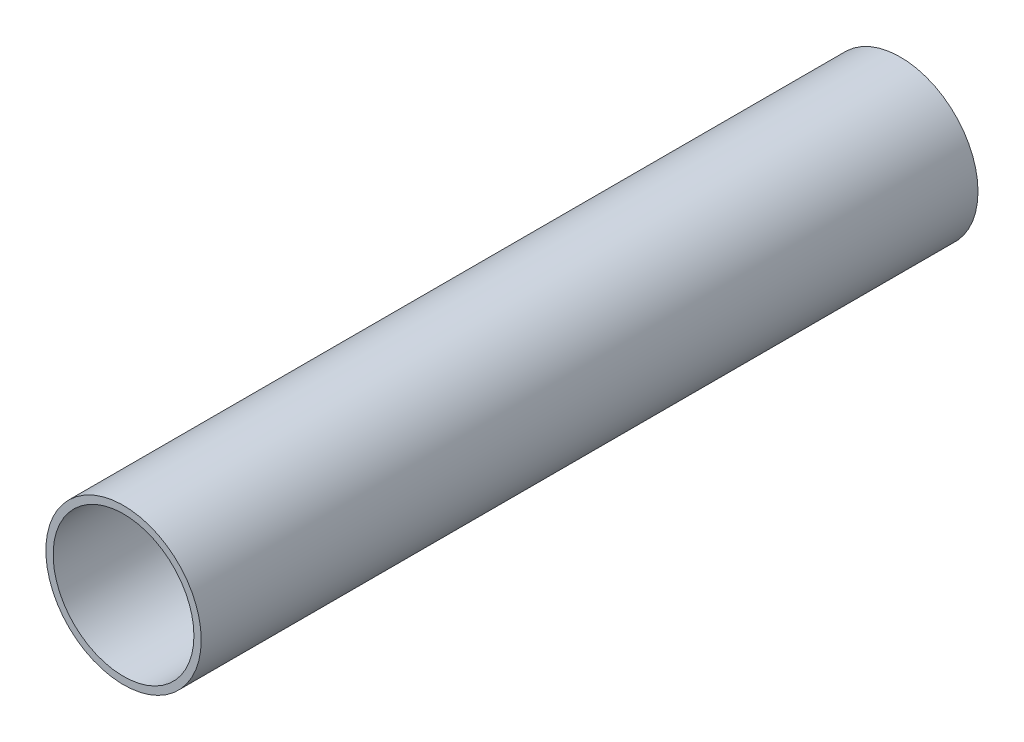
from build123d import *

# Parameters (mm, degrees)
SKETCH1_R          = 8
EXTRUDE1_DEPTH     = 80
SKETCH2_R          = 7.25
CUT_EXTRUDE1_DEPTH = 81.796039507


with BuildPart() as part:
    # Sketch1 → Extrude1 (new body)
    with BuildSketch(Plane.XY):
        Circle(SKETCH1_R)
    extrude(amount=-EXTRUDE1_DEPTH)

    # Sketch2 → Cut-Extrude1 (cut, through all)
    with BuildSketch(Plane.XY):
        Circle(SKETCH2_R)
    extrude(amount=-CUT_EXTRUDE1_DEPTH, mode=Mode.SUBTRACT)


solid = part.part
